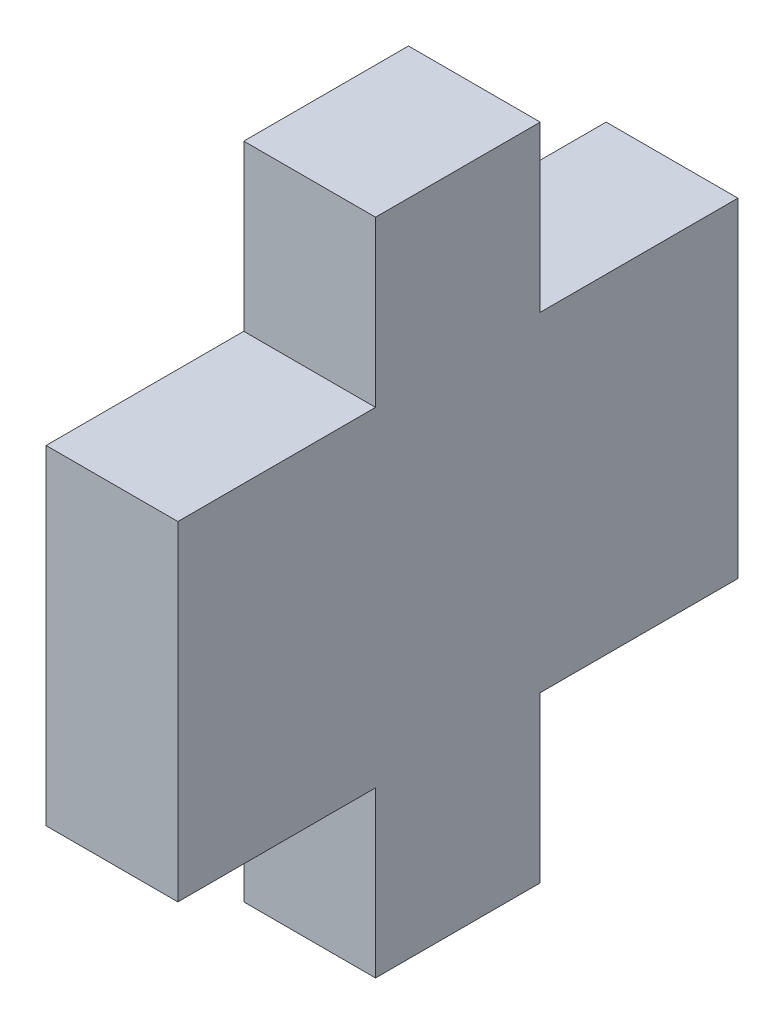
ISO-10303-21;
HEADER;
FILE_DESCRIPTION(('STEP AP214'),'2;1');
FILE_NAME('part.step','',(''),(''),'','','');
FILE_SCHEMA(('AUTOMOTIVE_DESIGN { 1 0 10303 214 1 1 1 1 }'));
ENDSEC;
DATA;
#1=APPLICATION_CONTEXT('core data for automotive mechanical design processes');
#2=APPLICATION_PROTOCOL_DEFINITION('international standard','automotive_design',2000,#1);
#3=PRODUCT_CONTEXT('',#1,'mechanical');
#4=PRODUCT('Part','Part','',(#3));
#5=PRODUCT_RELATED_PRODUCT_CATEGORY('part','',(#4));
#6=PRODUCT_DEFINITION_FORMATION('','',#4);
#7=PRODUCT_DEFINITION_CONTEXT('part definition',#1,'design');
#8=PRODUCT_DEFINITION('design','',#6,#7);
#9=PRODUCT_DEFINITION_SHAPE('','',#8);
#10=(LENGTH_UNIT() NAMED_UNIT(*) SI_UNIT(.MILLI.,.METRE.));
#11=(NAMED_UNIT(*) PLANE_ANGLE_UNIT() SI_UNIT($,.RADIAN.));
#12=(NAMED_UNIT(*) SI_UNIT($,.STERADIAN.) SOLID_ANGLE_UNIT());
#13=UNCERTAINTY_MEASURE_WITH_UNIT(LENGTH_MEASURE(1.E-05),#10,'distance_accuracy_value','');
#14=(GEOMETRIC_REPRESENTATION_CONTEXT(3) GLOBAL_UNCERTAINTY_ASSIGNED_CONTEXT((#13)) GLOBAL_UNIT_ASSIGNED_CONTEXT((#10,
#11,#12)) REPRESENTATION_CONTEXT('',''));
#15=CARTESIAN_POINT('',(0.,0.,0.));
#16=DIRECTION('',(0.,0.,1.));
#17=DIRECTION('',(1.,0.,0.));
#18=AXIS2_PLACEMENT_3D('',#15,#16,#17);
#19=CARTESIAN_POINT('',(10.,-25.,0.));
#20=DIRECTION('',(0.,1.,0.));
#21=DIRECTION('',(0.,0.,1.));
#22=AXIS2_PLACEMENT_3D('',#19,#20,#21);
#23=PLANE('',#22);
#24=DIRECTION('',(0.,0.,-1.));
#25=VECTOR('',#24,1.);
#26=CARTESIAN_POINT('',(-10.,-25.,0.));
#27=LINE('',#26,#25);
#28=CARTESIAN_POINT('',(-10.,-25.,0.));
#29=VERTEX_POINT('',#28);
#30=CARTESIAN_POINT('',(-10.,-25.,-30.));
#31=VERTEX_POINT('',#30);
#32=EDGE_CURVE('E125',#29,#31,#27,.T.);
#33=ORIENTED_EDGE('',*,*,#32,.T.);
#34=DIRECTION('',(-1.,0.,0.));
#35=VECTOR('',#34,1.);
#36=CARTESIAN_POINT('',(10.,-25.,-30.));
#37=LINE('',#36,#35);
#38=CARTESIAN_POINT('',(10.,-25.,-30.));
#39=VERTEX_POINT('',#38);
#40=EDGE_CURVE('E11',#39,#31,#37,.T.);
#41=ORIENTED_EDGE('',*,*,#40,.F.);
#42=DIRECTION('',(0.,0.,-1.));
#43=VECTOR('',#42,1.);
#44=CARTESIAN_POINT('',(10.,-25.,0.));
#45=LINE('',#44,#43);
#46=CARTESIAN_POINT('',(10.,-25.,0.));
#47=VERTEX_POINT('',#46);
#48=EDGE_CURVE('E160',#47,#39,#45,.T.);
#49=ORIENTED_EDGE('',*,*,#48,.F.);
#50=DIRECTION('',(-1.,0.,0.));
#51=VECTOR('',#50,1.);
#52=CARTESIAN_POINT('',(10.,-25.,0.));
#53=LINE('',#52,#51);
#54=EDGE_CURVE('E138',#47,#29,#53,.T.);
#55=ORIENTED_EDGE('',*,*,#54,.T.);
#56=EDGE_LOOP('',(#33,#41,#49,#55));
#57=FACE_BOUND('',#56,.T.);
#58=ADVANCED_FACE('F33',(#57),#23,.F.);
#59=CARTESIAN_POINT('',(10.,-25.,-30.));
#60=DIRECTION('',(0.,0.,-1.));
#61=DIRECTION('',(-1.,0.,0.));
#62=AXIS2_PLACEMENT_3D('',#59,#60,#61);
#63=PLANE('',#62);
#64=DIRECTION('',(0.,-1.,0.));
#65=VECTOR('',#64,1.);
#66=CARTESIAN_POINT('',(-10.,-25.,-30.));
#67=LINE('',#66,#65);
#68=CARTESIAN_POINT('',(-10.,-50.,-30.));
#69=VERTEX_POINT('',#68);
#70=EDGE_CURVE('E121',#31,#69,#67,.T.);
#71=ORIENTED_EDGE('',*,*,#70,.T.);
#72=DIRECTION('',(-1.,0.,0.));
#73=VECTOR('',#72,1.);
#74=CARTESIAN_POINT('',(10.,-50.,-30.));
#75=LINE('',#74,#73);
#76=CARTESIAN_POINT('',(10.,-50.,-30.));
#77=VERTEX_POINT('',#76);
#78=EDGE_CURVE('E40',#77,#69,#75,.T.);
#79=ORIENTED_EDGE('',*,*,#78,.F.);
#80=DIRECTION('',(0.,-1.,0.));
#81=VECTOR('',#80,1.);
#82=CARTESIAN_POINT('',(10.,-25.,-30.));
#83=LINE('',#82,#81);
#84=EDGE_CURVE('E134',#39,#77,#83,.T.);
#85=ORIENTED_EDGE('',*,*,#84,.F.);
#86=ORIENTED_EDGE('',*,*,#40,.T.);
#87=EDGE_LOOP('',(#71,#79,#85,#86));
#88=FACE_BOUND('',#87,.T.);
#89=ADVANCED_FACE('F133',(#88),#63,.F.);
#90=CARTESIAN_POINT('',(10.,-50.,-30.));
#91=DIRECTION('',(0.,1.,0.));
#92=DIRECTION('',(0.,0.,1.));
#93=AXIS2_PLACEMENT_3D('',#90,#91,#92);
#94=PLANE('',#93);
#95=DIRECTION('',(0.,0.,-1.));
#96=VECTOR('',#95,1.);
#97=CARTESIAN_POINT('',(-10.,-50.,-30.));
#98=LINE('',#97,#96);
#99=CARTESIAN_POINT('',(-10.,-50.,-55.));
#100=VERTEX_POINT('',#99);
#101=EDGE_CURVE('E127',#69,#100,#98,.T.);
#102=ORIENTED_EDGE('',*,*,#101,.T.);
#103=DIRECTION('',(-1.,0.,0.));
#104=VECTOR('',#103,1.);
#105=CARTESIAN_POINT('',(10.,-50.,-55.));
#106=LINE('',#105,#104);
#107=CARTESIAN_POINT('',(10.,-50.,-55.));
#108=VERTEX_POINT('',#107);
#109=EDGE_CURVE('E206',#108,#100,#106,.T.);
#110=ORIENTED_EDGE('',*,*,#109,.F.);
#111=DIRECTION('',(0.,0.,-1.));
#112=VECTOR('',#111,1.);
#113=CARTESIAN_POINT('',(10.,-50.,-30.));
#114=LINE('',#113,#112);
#115=EDGE_CURVE('E163',#77,#108,#114,.T.);
#116=ORIENTED_EDGE('',*,*,#115,.F.);
#117=ORIENTED_EDGE('',*,*,#78,.T.);
#118=EDGE_LOOP('',(#102,#110,#116,#117));
#119=FACE_BOUND('',#118,.T.);
#120=ADVANCED_FACE('F210',(#119),#94,.F.);
#121=CARTESIAN_POINT('',(10.,-50.,-55.));
#122=DIRECTION('',(0.,0.,1.));
#123=DIRECTION('',(1.,0.,0.));
#124=AXIS2_PLACEMENT_3D('',#121,#122,#123);
#125=PLANE('',#124);
#126=DIRECTION('',(0.,1.,0.));
#127=VECTOR('',#126,1.);
#128=CARTESIAN_POINT('',(-10.,-50.,-55.));
#129=LINE('',#128,#127);
#130=CARTESIAN_POINT('',(-10.,-25.,-55.));
#131=VERTEX_POINT('',#130);
#132=EDGE_CURVE('E142',#100,#131,#129,.T.);
#133=ORIENTED_EDGE('',*,*,#132,.T.);
#134=DIRECTION('',(-1.,0.,0.));
#135=VECTOR('',#134,1.);
#136=CARTESIAN_POINT('',(10.,-25.,-55.));
#137=LINE('',#136,#135);
#138=CARTESIAN_POINT('',(10.,-25.,-55.));
#139=VERTEX_POINT('',#138);
#140=EDGE_CURVE('E203',#139,#131,#137,.T.);
#141=ORIENTED_EDGE('',*,*,#140,.F.);
#142=DIRECTION('',(0.,1.,0.));
#143=VECTOR('',#142,1.);
#144=CARTESIAN_POINT('',(10.,-50.,-55.));
#145=LINE('',#144,#143);
#146=EDGE_CURVE('E165',#108,#139,#145,.T.);
#147=ORIENTED_EDGE('',*,*,#146,.F.);
#148=ORIENTED_EDGE('',*,*,#109,.T.);
#149=EDGE_LOOP('',(#133,#141,#147,#148));
#150=FACE_BOUND('',#149,.T.);
#151=ADVANCED_FACE('F218',(#150),#125,.F.);
#152=CARTESIAN_POINT('',(10.,-25.,-55.));
#153=DIRECTION('',(0.,1.,0.));
#154=DIRECTION('',(0.,0.,1.));
#155=AXIS2_PLACEMENT_3D('',#152,#153,#154);
#156=PLANE('',#155);
#157=DIRECTION('',(0.,0.,-1.));
#158=VECTOR('',#157,1.);
#159=CARTESIAN_POINT('',(-10.,-25.,-55.));
#160=LINE('',#159,#158);
#161=CARTESIAN_POINT('',(-10.,-25.,-85.));
#162=VERTEX_POINT('',#161);
#163=EDGE_CURVE('E144',#131,#162,#160,.T.);
#164=ORIENTED_EDGE('',*,*,#163,.T.);
#165=DIRECTION('',(-1.,0.,0.));
#166=VECTOR('',#165,1.);
#167=CARTESIAN_POINT('',(10.,-25.,-85.));
#168=LINE('',#167,#166);
#169=CARTESIAN_POINT('',(10.,-25.,-85.));
#170=VERTEX_POINT('',#169);
#171=EDGE_CURVE('E200',#170,#162,#168,.T.);
#172=ORIENTED_EDGE('',*,*,#171,.F.);
#173=DIRECTION('',(0.,0.,-1.));
#174=VECTOR('',#173,1.);
#175=CARTESIAN_POINT('',(10.,-25.,-55.));
#176=LINE('',#175,#174);
#177=EDGE_CURVE('E167',#139,#170,#176,.T.);
#178=ORIENTED_EDGE('',*,*,#177,.F.);
#179=ORIENTED_EDGE('',*,*,#140,.T.);
#180=EDGE_LOOP('',(#164,#172,#178,#179));
#181=FACE_BOUND('',#180,.T.);
#182=ADVANCED_FACE('F221',(#181),#156,.F.);
#183=CARTESIAN_POINT('',(10.,25.,-85.));
#184=DIRECTION('',(0.,0.,1.));
#185=DIRECTION('',(1.,0.,0.));
#186=AXIS2_PLACEMENT_3D('',#183,#184,#185);
#187=PLANE('',#186);
#188=DIRECTION('',(0.,1.,0.));
#189=VECTOR('',#188,1.);
#190=CARTESIAN_POINT('',(-10.,25.,-85.));
#191=LINE('',#190,#189);
#192=CARTESIAN_POINT('',(-10.,25.,-85.));
#193=VERTEX_POINT('',#192);
#194=EDGE_CURVE('E146',#162,#193,#191,.T.);
#195=ORIENTED_EDGE('',*,*,#194,.T.);
#196=DIRECTION('',(-1.,0.,0.));
#197=VECTOR('',#196,1.);
#198=CARTESIAN_POINT('',(10.,25.,-85.));
#199=LINE('',#198,#197);
#200=CARTESIAN_POINT('',(10.,25.,-85.));
#201=VERTEX_POINT('',#200);
#202=EDGE_CURVE('E197',#201,#193,#199,.T.);
#203=ORIENTED_EDGE('',*,*,#202,.F.);
#204=DIRECTION('',(0.,1.,0.));
#205=VECTOR('',#204,1.);
#206=CARTESIAN_POINT('',(10.,25.,-85.));
#207=LINE('',#206,#205);
#208=EDGE_CURVE('E169',#170,#201,#207,.T.);
#209=ORIENTED_EDGE('',*,*,#208,.F.);
#210=ORIENTED_EDGE('',*,*,#171,.T.);
#211=EDGE_LOOP('',(#195,#203,#209,#210));
#212=FACE_BOUND('',#211,.T.);
#213=ADVANCED_FACE('F226',(#212),#187,.F.);
#214=CARTESIAN_POINT('',(10.,25.,-55.));
#215=DIRECTION('',(0.,-1.,0.));
#216=DIRECTION('',(0.,0.,-1.));
#217=AXIS2_PLACEMENT_3D('',#214,#215,#216);
#218=PLANE('',#217);
#219=DIRECTION('',(0.,0.,1.));
#220=VECTOR('',#219,1.);
#221=CARTESIAN_POINT('',(-10.,25.,-55.));
#222=LINE('',#221,#220);
#223=CARTESIAN_POINT('',(-10.,25.,-55.));
#224=VERTEX_POINT('',#223);
#225=EDGE_CURVE('E148',#193,#224,#222,.T.);
#226=ORIENTED_EDGE('',*,*,#225,.T.);
#227=DIRECTION('',(-1.,0.,0.));
#228=VECTOR('',#227,1.);
#229=CARTESIAN_POINT('',(10.,25.,-55.));
#230=LINE('',#229,#228);
#231=CARTESIAN_POINT('',(10.,25.,-55.));
#232=VERTEX_POINT('',#231);
#233=EDGE_CURVE('E194',#232,#224,#230,.T.);
#234=ORIENTED_EDGE('',*,*,#233,.F.);
#235=DIRECTION('',(0.,0.,1.));
#236=VECTOR('',#235,1.);
#237=CARTESIAN_POINT('',(10.,25.,-55.));
#238=LINE('',#237,#236);
#239=EDGE_CURVE('E171',#201,#232,#238,.T.);
#240=ORIENTED_EDGE('',*,*,#239,.F.);
#241=ORIENTED_EDGE('',*,*,#202,.T.);
#242=EDGE_LOOP('',(#226,#234,#240,#241));
#243=FACE_BOUND('',#242,.T.);
#244=ADVANCED_FACE('F232',(#243),#218,.F.);
#245=CARTESIAN_POINT('',(10.,50.,-55.));
#246=DIRECTION('',(0.,0.,1.));
#247=DIRECTION('',(1.,0.,0.));
#248=AXIS2_PLACEMENT_3D('',#245,#246,#247);
#249=PLANE('',#248);
#250=DIRECTION('',(0.,1.,0.));
#251=VECTOR('',#250,1.);
#252=CARTESIAN_POINT('',(-10.,50.,-55.));
#253=LINE('',#252,#251);
#254=CARTESIAN_POINT('',(-10.,50.,-55.));
#255=VERTEX_POINT('',#254);
#256=EDGE_CURVE('E150',#224,#255,#253,.T.);
#257=ORIENTED_EDGE('',*,*,#256,.T.);
#258=DIRECTION('',(-1.,0.,0.));
#259=VECTOR('',#258,1.);
#260=CARTESIAN_POINT('',(10.,50.,-55.));
#261=LINE('',#260,#259);
#262=CARTESIAN_POINT('',(10.,50.,-55.));
#263=VERTEX_POINT('',#262);
#264=EDGE_CURVE('E191',#263,#255,#261,.T.);
#265=ORIENTED_EDGE('',*,*,#264,.F.);
#266=DIRECTION('',(0.,1.,0.));
#267=VECTOR('',#266,1.);
#268=CARTESIAN_POINT('',(10.,50.,-55.));
#269=LINE('',#268,#267);
#270=EDGE_CURVE('E173',#232,#263,#269,.T.);
#271=ORIENTED_EDGE('',*,*,#270,.F.);
#272=ORIENTED_EDGE('',*,*,#233,.T.);
#273=EDGE_LOOP('',(#257,#265,#271,#272));
#274=FACE_BOUND('',#273,.T.);
#275=ADVANCED_FACE('F236',(#274),#249,.F.);
#276=CARTESIAN_POINT('',(10.,50.,-30.));
#277=DIRECTION('',(0.,-1.,0.));
#278=DIRECTION('',(0.,0.,-1.));
#279=AXIS2_PLACEMENT_3D('',#276,#277,#278);
#280=PLANE('',#279);
#281=DIRECTION('',(0.,0.,1.));
#282=VECTOR('',#281,1.);
#283=CARTESIAN_POINT('',(-10.,50.,-30.));
#284=LINE('',#283,#282);
#285=CARTESIAN_POINT('',(-10.,50.,-30.));
#286=VERTEX_POINT('',#285);
#287=EDGE_CURVE('E152',#255,#286,#284,.T.);
#288=ORIENTED_EDGE('',*,*,#287,.T.);
#289=DIRECTION('',(-1.,0.,0.));
#290=VECTOR('',#289,1.);
#291=CARTESIAN_POINT('',(10.,50.,-30.));
#292=LINE('',#291,#290);
#293=CARTESIAN_POINT('',(10.,50.,-30.));
#294=VERTEX_POINT('',#293);
#295=EDGE_CURVE('E188',#294,#286,#292,.T.);
#296=ORIENTED_EDGE('',*,*,#295,.F.);
#297=DIRECTION('',(0.,0.,1.));
#298=VECTOR('',#297,1.);
#299=CARTESIAN_POINT('',(10.,50.,-30.));
#300=LINE('',#299,#298);
#301=EDGE_CURVE('E175',#263,#294,#300,.T.);
#302=ORIENTED_EDGE('',*,*,#301,.F.);
#303=ORIENTED_EDGE('',*,*,#264,.T.);
#304=EDGE_LOOP('',(#288,#296,#302,#303));
#305=FACE_BOUND('',#304,.T.);
#306=ADVANCED_FACE('F241',(#305),#280,.F.);
#307=CARTESIAN_POINT('',(10.,25.,-30.));
#308=DIRECTION('',(0.,0.,-1.));
#309=DIRECTION('',(-1.,0.,0.));
#310=AXIS2_PLACEMENT_3D('',#307,#308,#309);
#311=PLANE('',#310);
#312=DIRECTION('',(0.,-1.,0.));
#313=VECTOR('',#312,1.);
#314=CARTESIAN_POINT('',(-10.,25.,-30.));
#315=LINE('',#314,#313);
#316=CARTESIAN_POINT('',(-10.,25.,-30.));
#317=VERTEX_POINT('',#316);
#318=EDGE_CURVE('E154',#286,#317,#315,.T.);
#319=ORIENTED_EDGE('',*,*,#318,.T.);
#320=DIRECTION('',(-1.,0.,0.));
#321=VECTOR('',#320,1.);
#322=CARTESIAN_POINT('',(10.,25.,-30.));
#323=LINE('',#322,#321);
#324=CARTESIAN_POINT('',(10.,25.,-30.));
#325=VERTEX_POINT('',#324);
#326=EDGE_CURVE('E185',#325,#317,#323,.T.);
#327=ORIENTED_EDGE('',*,*,#326,.F.);
#328=DIRECTION('',(0.,-1.,0.));
#329=VECTOR('',#328,1.);
#330=CARTESIAN_POINT('',(10.,25.,-30.));
#331=LINE('',#330,#329);
#332=EDGE_CURVE('E177',#294,#325,#331,.T.);
#333=ORIENTED_EDGE('',*,*,#332,.F.);
#334=ORIENTED_EDGE('',*,*,#295,.T.);
#335=EDGE_LOOP('',(#319,#327,#333,#334));
#336=FACE_BOUND('',#335,.T.);
#337=ADVANCED_FACE('F245',(#336),#311,.F.);
#338=CARTESIAN_POINT('',(10.,25.,0.));
#339=DIRECTION('',(0.,-1.,0.));
#340=DIRECTION('',(0.,0.,-1.));
#341=AXIS2_PLACEMENT_3D('',#338,#339,#340);
#342=PLANE('',#341);
#343=DIRECTION('',(0.,0.,1.));
#344=VECTOR('',#343,1.);
#345=CARTESIAN_POINT('',(-10.,25.,0.));
#346=LINE('',#345,#344);
#347=CARTESIAN_POINT('',(-10.,25.,0.));
#348=VERTEX_POINT('',#347);
#349=EDGE_CURVE('E156',#317,#348,#346,.T.);
#350=ORIENTED_EDGE('',*,*,#349,.T.);
#351=DIRECTION('',(-1.,0.,0.));
#352=VECTOR('',#351,1.);
#353=CARTESIAN_POINT('',(10.,25.,0.));
#354=LINE('',#353,#352);
#355=CARTESIAN_POINT('',(10.,25.,0.));
#356=VERTEX_POINT('',#355);
#357=EDGE_CURVE('E182',#356,#348,#354,.T.);
#358=ORIENTED_EDGE('',*,*,#357,.F.);
#359=DIRECTION('',(0.,0.,1.));
#360=VECTOR('',#359,1.);
#361=CARTESIAN_POINT('',(10.,25.,0.));
#362=LINE('',#361,#360);
#363=EDGE_CURVE('E52',#325,#356,#362,.T.);
#364=ORIENTED_EDGE('',*,*,#363,.F.);
#365=ORIENTED_EDGE('',*,*,#326,.T.);
#366=EDGE_LOOP('',(#350,#358,#364,#365));
#367=FACE_BOUND('',#366,.T.);
#368=ADVANCED_FACE('F249',(#367),#342,.F.);
#369=CARTESIAN_POINT('',(10.,-25.,0.));
#370=DIRECTION('',(0.,0.,-1.));
#371=DIRECTION('',(-1.,0.,0.));
#372=AXIS2_PLACEMENT_3D('',#369,#370,#371);
#373=PLANE('',#372);
#374=DIRECTION('',(0.,-1.,0.));
#375=VECTOR('',#374,1.);
#376=CARTESIAN_POINT('',(-10.,-25.,0.));
#377=LINE('',#376,#375);
#378=EDGE_CURVE('E158',#348,#29,#377,.T.);
#379=ORIENTED_EDGE('',*,*,#378,.T.);
#380=ORIENTED_EDGE('',*,*,#54,.F.);
#381=DIRECTION('',(0.,-1.,0.));
#382=VECTOR('',#381,1.);
#383=CARTESIAN_POINT('',(10.,-25.,0.));
#384=LINE('',#383,#382);
#385=EDGE_CURVE('E47',#356,#47,#384,.T.);
#386=ORIENTED_EDGE('',*,*,#385,.F.);
#387=ORIENTED_EDGE('',*,*,#357,.T.);
#388=EDGE_LOOP('',(#379,#380,#386,#387));
#389=FACE_BOUND('',#388,.T.);
#390=ADVANCED_FACE('F251',(#389),#373,.F.);
#391=CARTESIAN_POINT('',(10.,-25.,-30.));
#392=DIRECTION('',(-1.,0.,0.));
#393=DIRECTION('',(0.,0.,1.));
#394=AXIS2_PLACEMENT_3D('',#391,#392,#393);
#395=PLANE('',#394);
#396=ORIENTED_EDGE('',*,*,#48,.T.);
#397=ORIENTED_EDGE('',*,*,#84,.T.);
#398=ORIENTED_EDGE('',*,*,#115,.T.);
#399=ORIENTED_EDGE('',*,*,#146,.T.);
#400=ORIENTED_EDGE('',*,*,#177,.T.);
#401=ORIENTED_EDGE('',*,*,#208,.T.);
#402=ORIENTED_EDGE('',*,*,#239,.T.);
#403=ORIENTED_EDGE('',*,*,#270,.T.);
#404=ORIENTED_EDGE('',*,*,#301,.T.);
#405=ORIENTED_EDGE('',*,*,#332,.T.);
#406=ORIENTED_EDGE('',*,*,#363,.T.);
#407=ORIENTED_EDGE('',*,*,#385,.T.);
#408=EDGE_LOOP('',(#396,#397,#398,#399,#400,#401,#402,#403,#404,#405,#406,#407));
#409=FACE_BOUND('',#408,.T.);
#410=ADVANCED_FACE('F213',(#409),#395,.F.);
#411=CARTESIAN_POINT('',(-10.,-25.,-30.));
#412=DIRECTION('',(-1.,0.,0.));
#413=DIRECTION('',(0.,0.,1.));
#414=AXIS2_PLACEMENT_3D('',#411,#412,#413);
#415=PLANE('',#414);
#416=ORIENTED_EDGE('',*,*,#32,.F.);
#417=ORIENTED_EDGE('',*,*,#378,.F.);
#418=ORIENTED_EDGE('',*,*,#349,.F.);
#419=ORIENTED_EDGE('',*,*,#318,.F.);
#420=ORIENTED_EDGE('',*,*,#287,.F.);
#421=ORIENTED_EDGE('',*,*,#256,.F.);
#422=ORIENTED_EDGE('',*,*,#225,.F.);
#423=ORIENTED_EDGE('',*,*,#194,.F.);
#424=ORIENTED_EDGE('',*,*,#163,.F.);
#425=ORIENTED_EDGE('',*,*,#132,.F.);
#426=ORIENTED_EDGE('',*,*,#101,.F.);
#427=ORIENTED_EDGE('',*,*,#70,.F.);
#428=EDGE_LOOP('',(#416,#417,#418,#419,#420,#421,#422,#423,#424,#425,#426,#427));
#429=FACE_BOUND('',#428,.T.);
#430=ADVANCED_FACE('F122',(#429),#415,.T.);
#431=CLOSED_SHELL('',(#58,#89,#120,#151,#182,#213,#244,#275,#306,#337,#368,#390,#410,#430));
#432=MANIFOLD_SOLID_BREP('B2',#431);
#433=ADVANCED_BREP_SHAPE_REPRESENTATION('',(#18,#432),#14);
#434=SHAPE_DEFINITION_REPRESENTATION(#9,#433);
ENDSEC;
END-ISO-10303-21;
